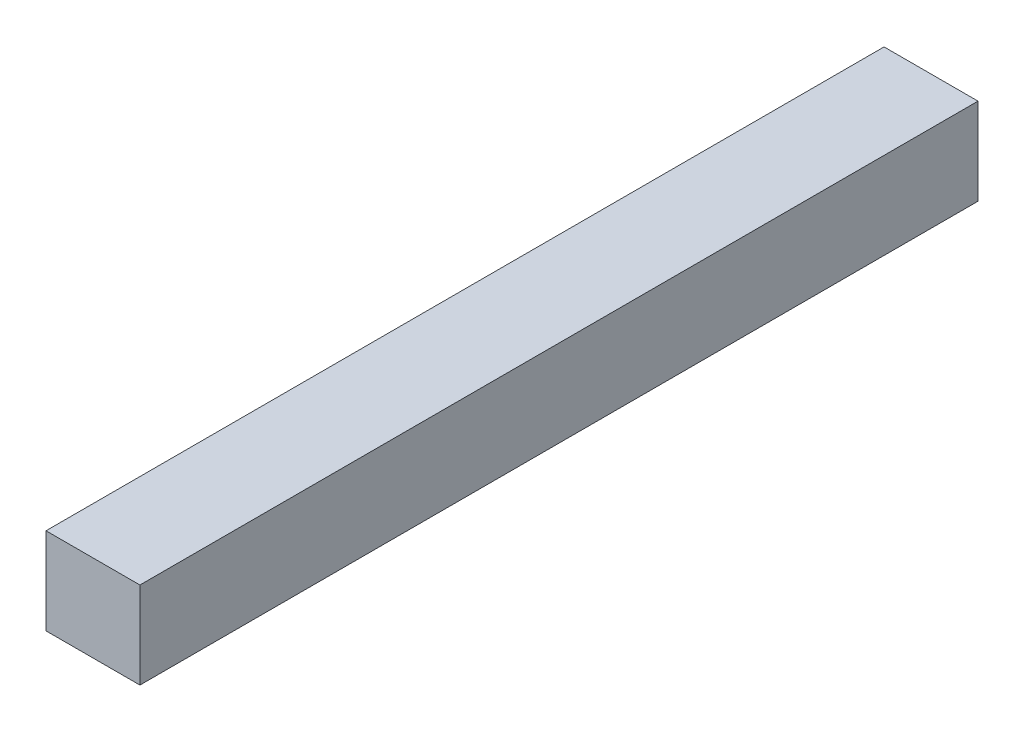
ISO-10303-21;
HEADER;
FILE_DESCRIPTION(('STEP AP214'),'2;1');
FILE_NAME('part.step','',(''),(''),'','','');
FILE_SCHEMA(('AUTOMOTIVE_DESIGN { 1 0 10303 214 1 1 1 1 }'));
ENDSEC;
DATA;
#1=APPLICATION_CONTEXT('core data for automotive mechanical design processes');
#2=APPLICATION_PROTOCOL_DEFINITION('international standard','automotive_design',2000,#1);
#3=PRODUCT_CONTEXT('',#1,'mechanical');
#4=PRODUCT('Part','Part','',(#3));
#5=PRODUCT_RELATED_PRODUCT_CATEGORY('part','',(#4));
#6=PRODUCT_DEFINITION_FORMATION('','',#4);
#7=PRODUCT_DEFINITION_CONTEXT('part definition',#1,'design');
#8=PRODUCT_DEFINITION('design','',#6,#7);
#9=PRODUCT_DEFINITION_SHAPE('','',#8);
#10=(LENGTH_UNIT() NAMED_UNIT(*) SI_UNIT(.MILLI.,.METRE.));
#11=(NAMED_UNIT(*) PLANE_ANGLE_UNIT() SI_UNIT($,.RADIAN.));
#12=(NAMED_UNIT(*) SI_UNIT($,.STERADIAN.) SOLID_ANGLE_UNIT());
#13=UNCERTAINTY_MEASURE_WITH_UNIT(LENGTH_MEASURE(1.E-05),#10,'distance_accuracy_value','');
#14=(GEOMETRIC_REPRESENTATION_CONTEXT(3) GLOBAL_UNCERTAINTY_ASSIGNED_CONTEXT((#13)) GLOBAL_UNIT_ASSIGNED_CONTEXT((#10,
#11,#12)) REPRESENTATION_CONTEXT('',''));
#15=CARTESIAN_POINT('',(0.,0.,0.));
#16=DIRECTION('',(0.,0.,1.));
#17=DIRECTION('',(1.,0.,0.));
#18=AXIS2_PLACEMENT_3D('',#15,#16,#17);
#19=CARTESIAN_POINT('',(32.5,30.,580.));
#20=DIRECTION('',(-1.,0.,0.));
#21=DIRECTION('',(0.,-1.,0.));
#22=AXIS2_PLACEMENT_3D('',#19,#20,#21);
#23=PLANE('',#22);
#24=DIRECTION('',(0.,1.,0.));
#25=VECTOR('',#24,1.);
#26=CARTESIAN_POINT('',(32.5,30.,0.));
#27=LINE('',#26,#25);
#28=CARTESIAN_POINT('',(32.5,-30.,0.));
#29=VERTEX_POINT('',#28);
#30=CARTESIAN_POINT('',(32.5,30.,0.));
#31=VERTEX_POINT('',#30);
#32=EDGE_CURVE('E95',#29,#31,#27,.T.);
#33=ORIENTED_EDGE('',*,*,#32,.T.);
#34=DIRECTION('',(0.,0.,-1.));
#35=VECTOR('',#34,1.);
#36=CARTESIAN_POINT('',(32.5,30.,580.));
#37=LINE('',#36,#35);
#38=CARTESIAN_POINT('',(32.5,30.,580.));
#39=VERTEX_POINT('',#38);
#40=EDGE_CURVE('E11',#39,#31,#37,.T.);
#41=ORIENTED_EDGE('',*,*,#40,.F.);
#42=DIRECTION('',(0.,1.,0.));
#43=VECTOR('',#42,1.);
#44=CARTESIAN_POINT('',(32.5,30.,580.));
#45=LINE('',#44,#43);
#46=CARTESIAN_POINT('',(32.5,-30.,580.));
#47=VERTEX_POINT('',#46);
#48=EDGE_CURVE('E83',#47,#39,#45,.T.);
#49=ORIENTED_EDGE('',*,*,#48,.F.);
#50=DIRECTION('',(0.,0.,-1.));
#51=VECTOR('',#50,1.);
#52=CARTESIAN_POINT('',(32.5,-30.,580.));
#53=LINE('',#52,#51);
#54=EDGE_CURVE('E91',#47,#29,#53,.T.);
#55=ORIENTED_EDGE('',*,*,#54,.T.);
#56=EDGE_LOOP('',(#33,#41,#49,#55));
#57=FACE_BOUND('',#56,.T.);
#58=ADVANCED_FACE('F32',(#57),#23,.F.);
#59=CARTESIAN_POINT('',(-32.5,30.,580.));
#60=DIRECTION('',(0.,-1.,0.));
#61=DIRECTION('',(0.,0.,-1.));
#62=AXIS2_PLACEMENT_3D('',#59,#60,#61);
#63=PLANE('',#62);
#64=DIRECTION('',(-1.,0.,0.));
#65=VECTOR('',#64,1.);
#66=CARTESIAN_POINT('',(-32.5,30.,0.));
#67=LINE('',#66,#65);
#68=CARTESIAN_POINT('',(-32.5,30.,0.));
#69=VERTEX_POINT('',#68);
#70=EDGE_CURVE('E87',#31,#69,#67,.T.);
#71=ORIENTED_EDGE('',*,*,#70,.T.);
#72=DIRECTION('',(0.,0.,-1.));
#73=VECTOR('',#72,1.);
#74=CARTESIAN_POINT('',(-32.5,30.,580.));
#75=LINE('',#74,#73);
#76=CARTESIAN_POINT('',(-32.5,30.,580.));
#77=VERTEX_POINT('',#76);
#78=EDGE_CURVE('E40',#77,#69,#75,.T.);
#79=ORIENTED_EDGE('',*,*,#78,.F.);
#80=DIRECTION('',(-1.,0.,0.));
#81=VECTOR('',#80,1.);
#82=CARTESIAN_POINT('',(-32.5,30.,580.));
#83=LINE('',#82,#81);
#84=EDGE_CURVE('E78',#39,#77,#83,.T.);
#85=ORIENTED_EDGE('',*,*,#84,.F.);
#86=ORIENTED_EDGE('',*,*,#40,.T.);
#87=EDGE_LOOP('',(#71,#79,#85,#86));
#88=FACE_BOUND('',#87,.T.);
#89=ADVANCED_FACE('F86',(#88),#63,.F.);
#90=CARTESIAN_POINT('',(-32.5,30.,580.));
#91=DIRECTION('',(1.,0.,0.));
#92=DIRECTION('',(0.,1.,0.));
#93=AXIS2_PLACEMENT_3D('',#90,#91,#92);
#94=PLANE('',#93);
#95=DIRECTION('',(0.,-1.,0.));
#96=VECTOR('',#95,1.);
#97=CARTESIAN_POINT('',(-32.5,30.,0.));
#98=LINE('',#97,#96);
#99=CARTESIAN_POINT('',(-32.5,-30.,0.));
#100=VERTEX_POINT('',#99);
#101=EDGE_CURVE('E65',#69,#100,#98,.T.);
#102=ORIENTED_EDGE('',*,*,#101,.T.);
#103=DIRECTION('',(0.,0.,-1.));
#104=VECTOR('',#103,1.);
#105=CARTESIAN_POINT('',(-32.5,-30.,580.));
#106=LINE('',#105,#104);
#107=CARTESIAN_POINT('',(-32.5,-30.,580.));
#108=VERTEX_POINT('',#107);
#109=EDGE_CURVE('E88',#108,#100,#106,.T.);
#110=ORIENTED_EDGE('',*,*,#109,.F.);
#111=DIRECTION('',(0.,-1.,0.));
#112=VECTOR('',#111,1.);
#113=CARTESIAN_POINT('',(-32.5,30.,580.));
#114=LINE('',#113,#112);
#115=EDGE_CURVE('E81',#77,#108,#114,.T.);
#116=ORIENTED_EDGE('',*,*,#115,.F.);
#117=ORIENTED_EDGE('',*,*,#78,.T.);
#118=EDGE_LOOP('',(#102,#110,#116,#117));
#119=FACE_BOUND('',#118,.T.);
#120=ADVANCED_FACE('F89',(#119),#94,.F.);
#121=CARTESIAN_POINT('',(-32.5,-30.,580.));
#122=DIRECTION('',(0.,1.,0.));
#123=DIRECTION('',(0.,0.,1.));
#124=AXIS2_PLACEMENT_3D('',#121,#122,#123);
#125=PLANE('',#124);
#126=DIRECTION('',(1.,0.,0.));
#127=VECTOR('',#126,1.);
#128=CARTESIAN_POINT('',(-32.5,-30.,0.));
#129=LINE('',#128,#127);
#130=EDGE_CURVE('E71',#100,#29,#129,.T.);
#131=ORIENTED_EDGE('',*,*,#130,.T.);
#132=ORIENTED_EDGE('',*,*,#54,.F.);
#133=DIRECTION('',(1.,0.,0.));
#134=VECTOR('',#133,1.);
#135=CARTESIAN_POINT('',(-32.5,-30.,580.));
#136=LINE('',#135,#134);
#137=EDGE_CURVE('E48',#108,#47,#136,.T.);
#138=ORIENTED_EDGE('',*,*,#137,.F.);
#139=ORIENTED_EDGE('',*,*,#109,.T.);
#140=EDGE_LOOP('',(#131,#132,#138,#139));
#141=FACE_BOUND('',#140,.T.);
#142=ADVANCED_FACE('F102',(#141),#125,.F.);
#143=CARTESIAN_POINT('',(0.,0.,580.));
#144=DIRECTION('',(0.,0.,1.));
#145=DIRECTION('',(1.,0.,0.));
#146=AXIS2_PLACEMENT_3D('',#143,#144,#145);
#147=PLANE('',#146);
#148=ORIENTED_EDGE('',*,*,#48,.T.);
#149=ORIENTED_EDGE('',*,*,#84,.T.);
#150=ORIENTED_EDGE('',*,*,#115,.T.);
#151=ORIENTED_EDGE('',*,*,#137,.T.);
#152=EDGE_LOOP('',(#148,#149,#150,#151));
#153=FACE_BOUND('',#152,.T.);
#154=ADVANCED_FACE('F79',(#153),#147,.T.);
#155=CARTESIAN_POINT('',(0.,0.,0.));
#156=DIRECTION('',(0.,0.,1.));
#157=DIRECTION('',(1.,0.,0.));
#158=AXIS2_PLACEMENT_3D('',#155,#156,#157);
#159=PLANE('',#158);
#160=ORIENTED_EDGE('',*,*,#32,.F.);
#161=ORIENTED_EDGE('',*,*,#130,.F.);
#162=ORIENTED_EDGE('',*,*,#101,.F.);
#163=ORIENTED_EDGE('',*,*,#70,.F.);
#164=EDGE_LOOP('',(#160,#161,#162,#163));
#165=FACE_BOUND('',#164,.T.);
#166=ADVANCED_FACE('F105',(#165),#159,.F.);
#167=CLOSED_SHELL('',(#58,#89,#120,#142,#154,#166));
#168=MANIFOLD_SOLID_BREP('B2',#167);
#169=ADVANCED_BREP_SHAPE_REPRESENTATION('',(#18,#168),#14);
#170=SHAPE_DEFINITION_REPRESENTATION(#9,#169);
ENDSEC;
END-ISO-10303-21;
